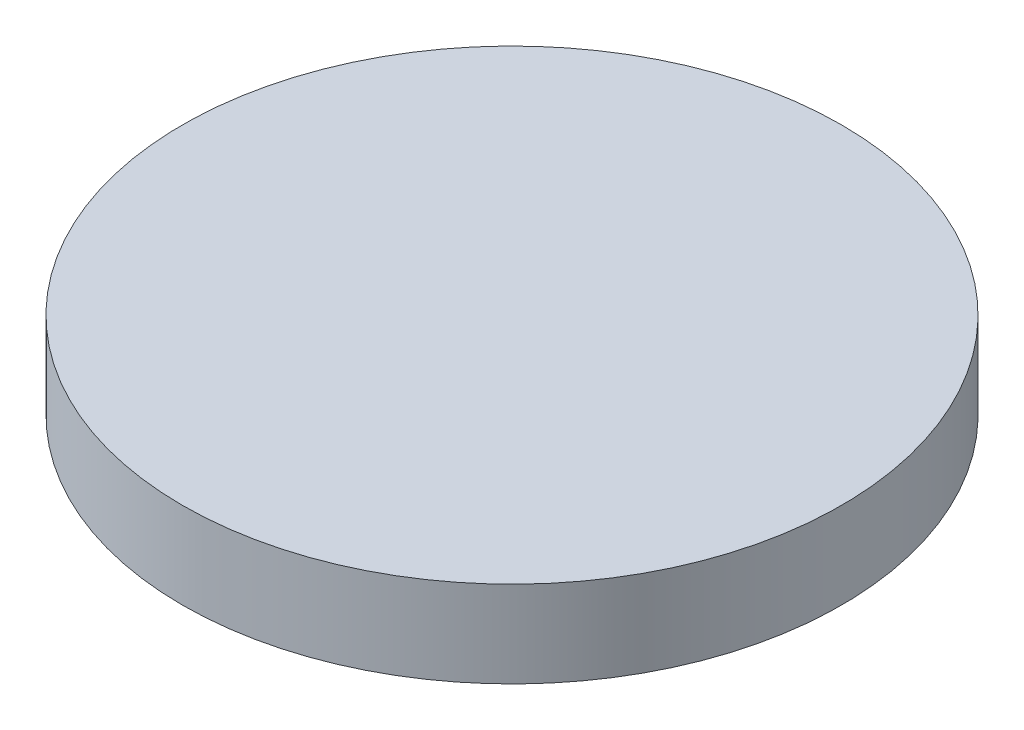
ISO-10303-21;
HEADER;
FILE_DESCRIPTION(('STEP AP214'),'2;1');
FILE_NAME('part.step','',(''),(''),'','','');
FILE_SCHEMA(('AUTOMOTIVE_DESIGN { 1 0 10303 214 1 1 1 1 }'));
ENDSEC;
DATA;
#1=APPLICATION_CONTEXT('core data for automotive mechanical design processes');
#2=APPLICATION_PROTOCOL_DEFINITION('international standard','automotive_design',2000,#1);
#3=PRODUCT_CONTEXT('',#1,'mechanical');
#4=PRODUCT('Part','Part','',(#3));
#5=PRODUCT_RELATED_PRODUCT_CATEGORY('part','',(#4));
#6=PRODUCT_DEFINITION_FORMATION('','',#4);
#7=PRODUCT_DEFINITION_CONTEXT('part definition',#1,'design');
#8=PRODUCT_DEFINITION('design','',#6,#7);
#9=PRODUCT_DEFINITION_SHAPE('','',#8);
#10=(LENGTH_UNIT() NAMED_UNIT(*) SI_UNIT(.MILLI.,.METRE.));
#11=(NAMED_UNIT(*) PLANE_ANGLE_UNIT() SI_UNIT($,.RADIAN.));
#12=(NAMED_UNIT(*) SI_UNIT($,.STERADIAN.) SOLID_ANGLE_UNIT());
#13=UNCERTAINTY_MEASURE_WITH_UNIT(LENGTH_MEASURE(1.E-05),#10,'distance_accuracy_value','');
#14=(GEOMETRIC_REPRESENTATION_CONTEXT(3) GLOBAL_UNCERTAINTY_ASSIGNED_CONTEXT((#13)) GLOBAL_UNIT_ASSIGNED_CONTEXT((#10,
#11,#12)) REPRESENTATION_CONTEXT('',''));
#15=CARTESIAN_POINT('',(0.,0.,0.));
#16=DIRECTION('',(0.,0.,1.));
#17=DIRECTION('',(1.,0.,0.));
#18=AXIS2_PLACEMENT_3D('',#15,#16,#17);
#19=CARTESIAN_POINT('',(0.,3.2258,0.));
#20=DIRECTION('',(0.,-1.,0.));
#21=DIRECTION('',(0.,0.,-1.));
#22=AXIS2_PLACEMENT_3D('',#19,#20,#21);
#23=CYLINDRICAL_SURFACE('',#22,12.303125);
#24=CARTESIAN_POINT('',(0.,3.2258,0.));
#25=DIRECTION('',(0.,1.,0.));
#26=DIRECTION('',(0.,0.,1.));
#27=AXIS2_PLACEMENT_3D('',#24,#25,#26);
#28=CIRCLE('',#27,12.303125);
#29=CARTESIAN_POINT('',(0.,3.2258,12.303125));
#30=VERTEX_POINT('',#29);
#31=EDGE_CURVE('E10',#30,#30,#28,.T.);
#32=ORIENTED_EDGE('',*,*,#31,.F.);
#33=EDGE_LOOP('',(#32));
#34=FACE_BOUND('',#33,.T.);
#35=CARTESIAN_POINT('',(0.,0.,0.));
#36=DIRECTION('',(0.,1.,0.));
#37=DIRECTION('',(0.,0.,1.));
#38=AXIS2_PLACEMENT_3D('',#35,#36,#37);
#39=CIRCLE('',#38,12.303125);
#40=CARTESIAN_POINT('',(0.,0.,12.303125));
#41=VERTEX_POINT('',#40);
#42=EDGE_CURVE('E36',#41,#41,#39,.T.);
#43=ORIENTED_EDGE('',*,*,#42,.T.);
#44=EDGE_LOOP('',(#43));
#45=FACE_BOUND('',#44,.T.);
#46=ADVANCED_FACE('F33',(#34,#45),#23,.T.);
#47=CARTESIAN_POINT('',(0.,3.2258,0.));
#48=DIRECTION('',(0.,1.,0.));
#49=DIRECTION('',(0.,0.,1.));
#50=AXIS2_PLACEMENT_3D('',#47,#48,#49);
#51=PLANE('',#50);
#52=ORIENTED_EDGE('',*,*,#31,.T.);
#53=EDGE_LOOP('',(#52));
#54=FACE_BOUND('',#53,.T.);
#55=ADVANCED_FACE('F48',(#54),#51,.T.);
#56=CARTESIAN_POINT('',(0.,0.,0.));
#57=DIRECTION('',(0.,1.,0.));
#58=DIRECTION('',(0.,0.,1.));
#59=AXIS2_PLACEMENT_3D('',#56,#57,#58);
#60=PLANE('',#59);
#61=ORIENTED_EDGE('',*,*,#42,.F.);
#62=EDGE_LOOP('',(#61));
#63=FACE_BOUND('',#62,.T.);
#64=ADVANCED_FACE('F46',(#63),#60,.F.);
#65=CLOSED_SHELL('',(#46,#55,#64));
#66=MANIFOLD_SOLID_BREP('B2',#65);
#67=ADVANCED_BREP_SHAPE_REPRESENTATION('',(#18,#66),#14);
#68=SHAPE_DEFINITION_REPRESENTATION(#9,#67);
ENDSEC;
END-ISO-10303-21;
